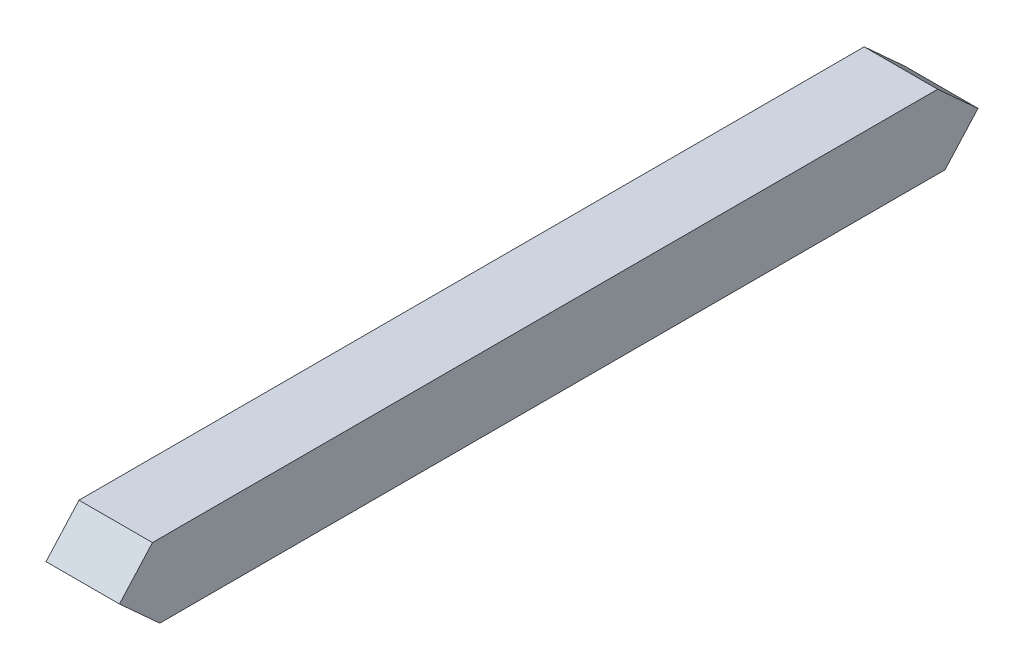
from build123d import *

# Parameters (mm, degrees)
ESQUISSE1_W                  = 67
ESQUISSE1_H                  = 67
BOSS_EXTRU_1_DEPTH           = 783
ENL_V_MAT_EXTRU_2_DEPTH      = 785.431960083
ENL_V_MAT_EXTRU_2_DEPTH_BACK = 785.431960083


with BuildPart() as part:
    # Esquisse1 → Boss.-Extru.1 (new body)
    with BuildSketch(Plane.XY):
        Rectangle(ESQUISSE1_W, ESQUISSE1_H)
    extrude(amount=BOSS_EXTRU_1_DEPTH)

    # Esquisse5 → Enl_v. mat.-Extru.2 (cut, two sides: drawn at the far end of the back side and taken through both)
    with BuildSketch(Plane(origin=(0, 0, 0), x_dir=(0, 0, -1), z_dir=(1, 0, 0)).offset(-ENL_V_MAT_EXTRU_2_DEPTH_BACK)):
        Polygon((-746.221975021, -33.5), (-783, 0), (-783, -33.5), align=None)
        Polygon((-783, 33.5), (-783, 0), (-752.914037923, 33.5), align=None)
        Polygon((0, 0), (-30.085962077, -33.5), (0, -33.5), align=None)
        Polygon((-36.778024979, 33.5), (0, 0), (0, 33.5), align=None)
    extrude(amount=ENL_V_MAT_EXTRU_2_DEPTH + ENL_V_MAT_EXTRU_2_DEPTH_BACK, mode=Mode.SUBTRACT)


solid = part.part
